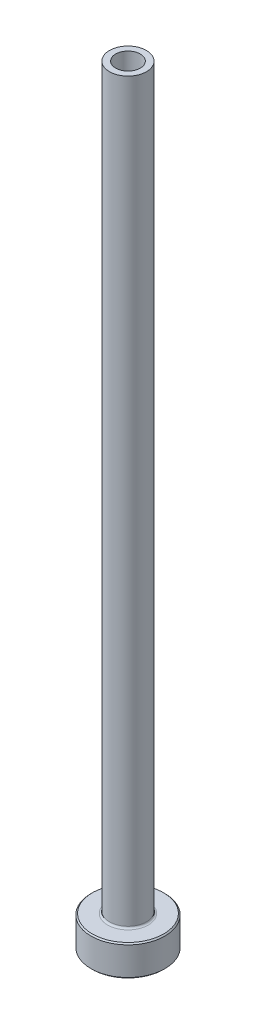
ISO-10303-21;
HEADER;
FILE_DESCRIPTION(('STEP AP214'),'2;1');
FILE_NAME('part.step','',(''),(''),'','','');
FILE_SCHEMA(('AUTOMOTIVE_DESIGN { 1 0 10303 214 1 1 1 1 }'));
ENDSEC;
DATA;
#1=APPLICATION_CONTEXT('core data for automotive mechanical design processes');
#2=APPLICATION_PROTOCOL_DEFINITION('international standard','automotive_design',2000,#1);
#3=PRODUCT_CONTEXT('',#1,'mechanical');
#4=PRODUCT('Part','Part','',(#3));
#5=PRODUCT_RELATED_PRODUCT_CATEGORY('part','',(#4));
#6=PRODUCT_DEFINITION_FORMATION('','',#4);
#7=PRODUCT_DEFINITION_CONTEXT('part definition',#1,'design');
#8=PRODUCT_DEFINITION('design','',#6,#7);
#9=PRODUCT_DEFINITION_SHAPE('','',#8);
#10=(LENGTH_UNIT() NAMED_UNIT(*) SI_UNIT(.MILLI.,.METRE.));
#11=(NAMED_UNIT(*) PLANE_ANGLE_UNIT() SI_UNIT($,.RADIAN.));
#12=(NAMED_UNIT(*) SI_UNIT($,.STERADIAN.) SOLID_ANGLE_UNIT());
#13=UNCERTAINTY_MEASURE_WITH_UNIT(LENGTH_MEASURE(1.E-05),#10,'distance_accuracy_value','');
#14=(GEOMETRIC_REPRESENTATION_CONTEXT(3) GLOBAL_UNCERTAINTY_ASSIGNED_CONTEXT((#13)) GLOBAL_UNIT_ASSIGNED_CONTEXT((#10,
#11,#12)) REPRESENTATION_CONTEXT('',''));
#15=CARTESIAN_POINT('',(0.,0.,0.));
#16=DIRECTION('',(0.,0.,1.));
#17=DIRECTION('',(1.,0.,0.));
#18=AXIS2_PLACEMENT_3D('',#15,#16,#17);
#19=CARTESIAN_POINT('',(0.,92.1876809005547,0.));
#20=DIRECTION('',(0.,1.,0.));
#21=DIRECTION('',(0.,0.,1.));
#22=AXIS2_PLACEMENT_3D('',#19,#20,#21);
#23=CYLINDRICAL_SURFACE('',#22,1.99999999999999);
#24=CARTESIAN_POINT('',(0.,125.,0.));
#25=DIRECTION('',(0.,1.,0.));
#26=DIRECTION('',(0.,0.,1.));
#27=AXIS2_PLACEMENT_3D('',#24,#25,#26);
#28=CIRCLE('',#27,2.);
#29=CARTESIAN_POINT('',(0.,125.,2.));
#30=VERTEX_POINT('',#29);
#31=EDGE_CURVE('E62',#30,#30,#28,.T.);
#32=ORIENTED_EDGE('',*,*,#31,.T.);
#33=EDGE_LOOP('',(#32));
#34=FACE_BOUND('',#33,.T.);
#35=CARTESIAN_POINT('',(0.,80.,0.));
#36=DIRECTION('',(0.,1.,0.));
#37=DIRECTION('',(0.,0.,1.));
#38=AXIS2_PLACEMENT_3D('',#35,#36,#37);
#39=CIRCLE('',#38,1.99999999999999);
#40=CARTESIAN_POINT('',(0.,80.,1.99999999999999));
#41=VERTEX_POINT('',#40);
#42=EDGE_CURVE('E71',#41,#41,#39,.T.);
#43=ORIENTED_EDGE('',*,*,#42,.F.);
#44=EDGE_LOOP('',(#43));
#45=FACE_BOUND('',#44,.T.);
#46=ADVANCED_FACE('F30',(#34,#45),#23,.F.);
#47=CARTESIAN_POINT('',(-2.,125.,0.));
#48=DIRECTION('',(0.,1.,0.));
#49=DIRECTION('',(0.,0.,1.));
#50=AXIS2_PLACEMENT_3D('',#47,#48,#49);
#51=PLANE('',#50);
#52=CARTESIAN_POINT('',(0.,125.,0.));
#53=DIRECTION('',(0.,1.,0.));
#54=DIRECTION('',(0.,0.,1.));
#55=AXIS2_PLACEMENT_3D('',#52,#53,#54);
#56=CIRCLE('',#55,3.);
#57=CARTESIAN_POINT('',(0.,125.,3.));
#58=VERTEX_POINT('',#57);
#59=EDGE_CURVE('E65',#58,#58,#56,.T.);
#60=ORIENTED_EDGE('',*,*,#59,.T.);
#61=EDGE_LOOP('',(#60));
#62=FACE_BOUND('',#61,.T.);
#63=ORIENTED_EDGE('',*,*,#31,.F.);
#64=EDGE_LOOP('',(#63));
#65=FACE_BOUND('',#64,.T.);
#66=ADVANCED_FACE('F79',(#62,#65),#51,.T.);
#67=CARTESIAN_POINT('',(0.,92.1876809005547,0.));
#68=DIRECTION('',(0.,1.,0.));
#69=DIRECTION('',(0.,0.,1.));
#70=AXIS2_PLACEMENT_3D('',#67,#68,#69);
#71=CYLINDRICAL_SURFACE('',#70,3.);
#72=CARTESIAN_POINT('',(0.,5.3,0.));
#73=DIRECTION('',(0.,1.,0.));
#74=DIRECTION('',(0.,0.,1.));
#75=AXIS2_PLACEMENT_3D('',#72,#73,#74);
#76=CIRCLE('',#75,3.);
#77=CARTESIAN_POINT('',(0.,5.3,3.));
#78=VERTEX_POINT('',#77);
#79=EDGE_CURVE('E59',#78,#78,#76,.T.);
#80=ORIENTED_EDGE('',*,*,#79,.T.);
#81=EDGE_LOOP('',(#80));
#82=FACE_BOUND('',#81,.T.);
#83=ORIENTED_EDGE('',*,*,#59,.F.);
#84=EDGE_LOOP('',(#83));
#85=FACE_BOUND('',#84,.T.);
#86=ADVANCED_FACE('F85',(#82,#85),#71,.T.);
#87=CARTESIAN_POINT('',(-2.99999999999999,5.,0.));
#88=DIRECTION('',(0.,1.,0.));
#89=DIRECTION('',(0.,0.,1.));
#90=AXIS2_PLACEMENT_3D('',#87,#88,#89);
#91=PLANE('',#90);
#92=CARTESIAN_POINT('',(0.,5.,0.));
#93=DIRECTION('',(0.,1.,0.));
#94=DIRECTION('',(0.,0.,1.));
#95=AXIS2_PLACEMENT_3D('',#92,#93,#94);
#96=CIRCLE('',#95,5.79999999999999);
#97=CARTESIAN_POINT('',(0.,5.,5.79999999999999));
#98=VERTEX_POINT('',#97);
#99=EDGE_CURVE('E53',#98,#98,#96,.T.);
#100=ORIENTED_EDGE('',*,*,#99,.T.);
#101=EDGE_LOOP('',(#100));
#102=FACE_BOUND('',#101,.T.);
#103=CARTESIAN_POINT('',(0.,5.,0.));
#104=DIRECTION('',(0.,1.,0.));
#105=DIRECTION('',(0.,0.,1.));
#106=AXIS2_PLACEMENT_3D('',#103,#104,#105);
#107=CIRCLE('',#106,3.3);
#108=CARTESIAN_POINT('',(0.,5.,3.3));
#109=VERTEX_POINT('',#108);
#110=EDGE_CURVE('E56',#109,#109,#107,.F.);
#111=ORIENTED_EDGE('',*,*,#110,.T.);
#112=EDGE_LOOP('',(#111));
#113=FACE_BOUND('',#112,.T.);
#114=ADVANCED_FACE('F111',(#102,#113),#91,.T.);
#115=CARTESIAN_POINT('',(0.,92.1876809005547,0.));
#116=DIRECTION('',(0.,1.,0.));
#117=DIRECTION('',(0.,0.,1.));
#118=AXIS2_PLACEMENT_3D('',#115,#116,#117);
#119=CYLINDRICAL_SURFACE('',#118,5.99999999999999);
#120=CARTESIAN_POINT('',(0.,4.8,0.));
#121=DIRECTION('',(0.,1.,0.));
#122=DIRECTION('',(0.,0.,1.));
#123=AXIS2_PLACEMENT_3D('',#120,#121,#122);
#124=CIRCLE('',#123,5.99999999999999);
#125=CARTESIAN_POINT('',(0.,4.8,5.99999999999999));
#126=VERTEX_POINT('',#125);
#127=EDGE_CURVE('E45',#126,#126,#124,.F.);
#128=ORIENTED_EDGE('',*,*,#127,.T.);
#129=EDGE_LOOP('',(#128));
#130=FACE_BOUND('',#129,.T.);
#131=CARTESIAN_POINT('',(0.,0.20000000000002,0.));
#132=DIRECTION('',(0.,-1.,0.));
#133=DIRECTION('',(0.,0.,-1.));
#134=AXIS2_PLACEMENT_3D('',#131,#132,#133);
#135=CIRCLE('',#134,5.99999999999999);
#136=CARTESIAN_POINT('',(0.,0.20000000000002,-5.99999999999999));
#137=VERTEX_POINT('',#136);
#138=EDGE_CURVE('E50',#137,#137,#135,.F.);
#139=ORIENTED_EDGE('',*,*,#138,.T.);
#140=EDGE_LOOP('',(#139));
#141=FACE_BOUND('',#140,.T.);
#142=ADVANCED_FACE('F108',(#130,#141),#119,.T.);
#143=CARTESIAN_POINT('',(-5.99999999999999,0.,0.));
#144=DIRECTION('',(0.,-1.,0.));
#145=DIRECTION('',(0.,0.,-1.));
#146=AXIS2_PLACEMENT_3D('',#143,#144,#145);
#147=PLANE('',#146);
#148=CARTESIAN_POINT('',(0.,0.,0.));
#149=DIRECTION('',(0.,-1.,0.));
#150=DIRECTION('',(0.,0.,-1.));
#151=AXIS2_PLACEMENT_3D('',#148,#149,#150);
#152=CIRCLE('',#151,2.74999999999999);
#153=CARTESIAN_POINT('',(0.,0.,-2.74999999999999));
#154=VERTEX_POINT('',#153);
#155=EDGE_CURVE('E37',#154,#154,#152,.F.);
#156=ORIENTED_EDGE('',*,*,#155,.T.);
#157=EDGE_LOOP('',(#156));
#158=FACE_BOUND('',#157,.T.);
#159=CARTESIAN_POINT('',(0.,0.,0.));
#160=DIRECTION('',(0.,-1.,0.));
#161=DIRECTION('',(0.,0.,-1.));
#162=AXIS2_PLACEMENT_3D('',#159,#160,#161);
#163=CIRCLE('',#162,5.79999999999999);
#164=CARTESIAN_POINT('',(0.,0.,-5.79999999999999));
#165=VERTEX_POINT('',#164);
#166=EDGE_CURVE('E41',#165,#165,#163,.T.);
#167=ORIENTED_EDGE('',*,*,#166,.T.);
#168=EDGE_LOOP('',(#167));
#169=FACE_BOUND('',#168,.T.);
#170=ADVANCED_FACE('F110',(#158,#169),#147,.T.);
#171=CARTESIAN_POINT('',(0.,92.1876809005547,0.));
#172=DIRECTION('',(0.,1.,0.));
#173=DIRECTION('',(0.,0.,1.));
#174=AXIS2_PLACEMENT_3D('',#171,#172,#173);
#175=CYLINDRICAL_SURFACE('',#174,2.24999999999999);
#176=CARTESIAN_POINT('',(0.,0.499999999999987,0.));
#177=DIRECTION('',(0.,-1.,0.));
#178=DIRECTION('',(0.,0.,-1.));
#179=AXIS2_PLACEMENT_3D('',#176,#177,#178);
#180=CIRCLE('',#179,2.24999999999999);
#181=CARTESIAN_POINT('',(0.,0.499999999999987,-2.24999999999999));
#182=VERTEX_POINT('',#181);
#183=EDGE_CURVE('E10',#182,#182,#180,.T.);
#184=ORIENTED_EDGE('',*,*,#183,.T.);
#185=EDGE_LOOP('',(#184));
#186=FACE_BOUND('',#185,.T.);
#187=CARTESIAN_POINT('',(0.,68.,0.));
#188=DIRECTION('',(0.,1.,0.));
#189=DIRECTION('',(0.,0.,1.));
#190=AXIS2_PLACEMENT_3D('',#187,#188,#189);
#191=CIRCLE('',#190,2.25);
#192=CARTESIAN_POINT('',(0.,68.,2.25));
#193=VERTEX_POINT('',#192);
#194=EDGE_CURVE('E68',#193,#193,#191,.T.);
#195=ORIENTED_EDGE('',*,*,#194,.T.);
#196=EDGE_LOOP('',(#195));
#197=FACE_BOUND('',#196,.T.);
#198=ADVANCED_FACE('F118',(#186,#197),#175,.F.);
#199=CARTESIAN_POINT('',(0.,68.,0.));
#200=DIRECTION('',(0.,-1.,0.));
#201=DIRECTION('',(0.,0.,-1.));
#202=AXIS2_PLACEMENT_3D('',#199,#200,#201);
#203=CONICAL_SURFACE('',#202,2.25,0.0208303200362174);
#204=ORIENTED_EDGE('',*,*,#42,.T.);
#205=EDGE_LOOP('',(#204));
#206=FACE_BOUND('',#205,.T.);
#207=ORIENTED_EDGE('',*,*,#194,.F.);
#208=EDGE_LOOP('',(#207));
#209=FACE_BOUND('',#208,.T.);
#210=ADVANCED_FACE('F75',(#206,#209),#203,.F.);
#211=CARTESIAN_POINT('',(0.,5.3,0.));
#212=DIRECTION('',(0.,1.,0.));
#213=DIRECTION('',(0.,0.,1.));
#214=AXIS2_PLACEMENT_3D('',#211,#212,#213);
#215=TOROIDAL_SURFACE('',#214,3.3,0.3);
#216=ORIENTED_EDGE('',*,*,#110,.F.);
#217=EDGE_LOOP('',(#216));
#218=FACE_BOUND('',#217,.T.);
#219=ORIENTED_EDGE('',*,*,#79,.F.);
#220=EDGE_LOOP('',(#219));
#221=FACE_BOUND('',#220,.T.);
#222=ADVANCED_FACE('F90',(#218,#221),#215,.F.);
#223=CARTESIAN_POINT('',(0.,5.,0.));
#224=DIRECTION('',(0.,-1.,0.));
#225=DIRECTION('',(0.,0.,-1.));
#226=AXIS2_PLACEMENT_3D('',#223,#224,#225);
#227=CONICAL_SURFACE('',#226,5.79999999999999,0.785398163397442);
#228=ORIENTED_EDGE('',*,*,#127,.F.);
#229=EDGE_LOOP('',(#228));
#230=FACE_BOUND('',#229,.T.);
#231=ORIENTED_EDGE('',*,*,#99,.F.);
#232=EDGE_LOOP('',(#231));
#233=FACE_BOUND('',#232,.T.);
#234=ADVANCED_FACE('F93',(#230,#233),#227,.T.);
#235=CARTESIAN_POINT('',(0.,0.20000000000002,0.));
#236=DIRECTION('',(0.,1.,0.));
#237=DIRECTION('',(0.,0.,1.));
#238=AXIS2_PLACEMENT_3D('',#235,#236,#237);
#239=CONICAL_SURFACE('',#238,5.99999999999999,0.785398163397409);
#240=ORIENTED_EDGE('',*,*,#166,.F.);
#241=EDGE_LOOP('',(#240));
#242=FACE_BOUND('',#241,.T.);
#243=ORIENTED_EDGE('',*,*,#138,.F.);
#244=EDGE_LOOP('',(#243));
#245=FACE_BOUND('',#244,.T.);
#246=ADVANCED_FACE('F96',(#242,#245),#239,.T.);
#247=CARTESIAN_POINT('',(0.,0.,0.));
#248=DIRECTION('',(0.,-1.,0.));
#249=DIRECTION('',(0.,0.,-1.));
#250=AXIS2_PLACEMENT_3D('',#247,#248,#249);
#251=CONICAL_SURFACE('',#250,2.74999999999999,0.785398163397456);
#252=ORIENTED_EDGE('',*,*,#183,.F.);
#253=EDGE_LOOP('',(#252));
#254=FACE_BOUND('',#253,.T.);
#255=ORIENTED_EDGE('',*,*,#155,.F.);
#256=EDGE_LOOP('',(#255));
#257=FACE_BOUND('',#256,.T.);
#258=ADVANCED_FACE('F32',(#254,#257),#251,.F.);
#259=CLOSED_SHELL('',(#46,#66,#86,#114,#142,#170,#198,#210,#222,#234,#246,#258));
#260=MANIFOLD_SOLID_BREP('B2',#259);
#261=ADVANCED_BREP_SHAPE_REPRESENTATION('',(#18,#260),#14);
#262=SHAPE_DEFINITION_REPRESENTATION(#9,#261);
ENDSEC;
END-ISO-10303-21;
